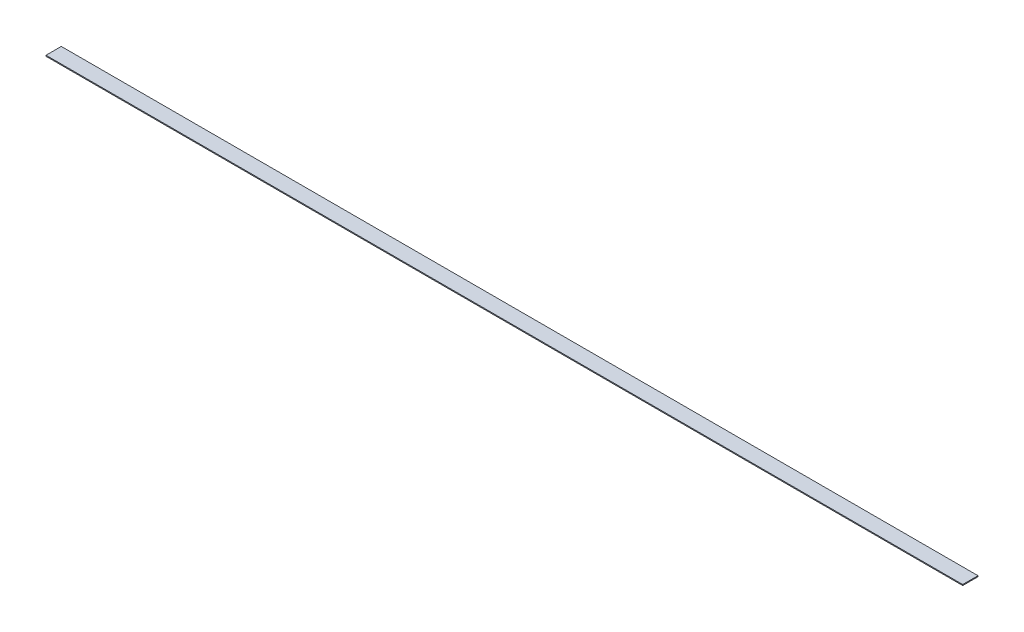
from build123d import *

# Parameters (mm, degrees)
SKETCH1_W           = 6096
SKETCH1_H           = 101.6
BOSS_EXTRUDE1_DEPTH = 6.35


with BuildPart() as part:
    # Sketch1 → Boss-Extrude1 (new body)
    with BuildSketch(Plane(origin=(0, 0, 0), x_dir=(1, 0, 0), z_dir=(0, 1, 0))):
        Rectangle(SKETCH1_W, SKETCH1_H)
    extrude(amount=BOSS_EXTRUDE1_DEPTH)


solid = part.part
